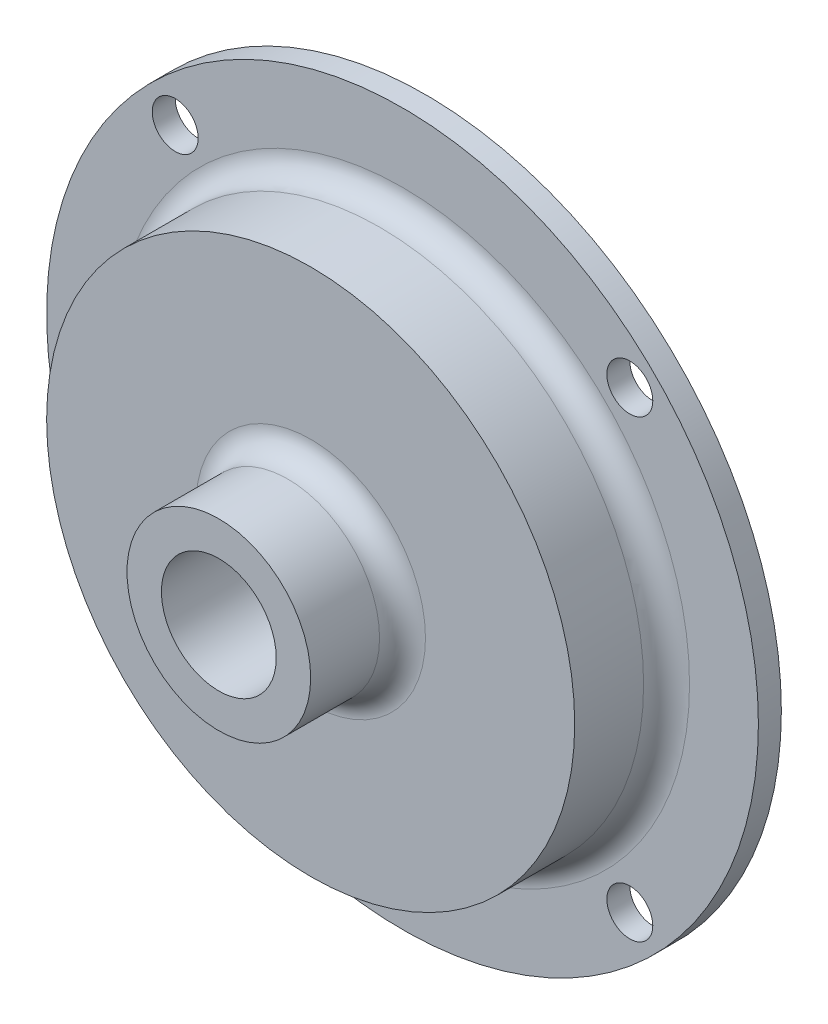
from build123d import *

# Parameters (mm, degrees)
SKETCH1_R           = 49.2125
SKETCH1_R_2         = 3.175
BASE_EXTRUDE_DEPTH  = 3.175
SKETCH2_R           = 36.5125
BOSS_EXTRUDE1_DEPTH = 12.7
SKETCH3_R           = 12.7
BOSS_EXTRUDE2_DEPTH = 12.7
FILLET1_R           = 3.175
SKETCH4_R           = 7.9375
CUT_EXTRUDE1_DEPTH  = 76.23477213


with BuildPart() as part:
    # Sketch1 → Base-Extrude (new body)
    with BuildSketch(Plane.XY):
        Circle(SKETCH1_R)
        with Locations((31.430896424, 31.430896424)):
            Circle(SKETCH1_R_2, mode=Mode.SUBTRACT)
        with Locations((-31.430896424, -31.430896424)):
            Circle(SKETCH1_R_2, mode=Mode.SUBTRACT)
        with Locations((31.430896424, -31.430896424)):
            Circle(SKETCH1_R_2, mode=Mode.SUBTRACT)
        with Locations((-31.430896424, 31.430896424)):
            Circle(SKETCH1_R_2, mode=Mode.SUBTRACT)
    extrude(amount=BASE_EXTRUDE_DEPTH)

    # Sketch2 → Boss-Extrude1 (add)
    with BuildSketch(Plane.XY.offset(3.175)):
        Circle(SKETCH2_R)
    extrude(amount=BOSS_EXTRUDE1_DEPTH)

    # Sketch3 → Boss-Extrude2 (add)
    with BuildSketch(Plane.XY.offset(15.875)):
        Circle(SKETCH3_R)
    extrude(amount=BOSS_EXTRUDE2_DEPTH)

    # Fillet1
    fillet1_edges = [part.edges().sort_by_distance(p)[0] for p in [
        (-36.5125, 0, 3.175),
        (-12.7, 0, 15.875),
    ]]
    fillet(fillet1_edges, radius=FILLET1_R)

    # Sketch4 → Cut-Extrude1 (cut, through all)
    with BuildSketch(Plane.XY.offset(28.575)):
        Circle(SKETCH4_R)
    extrude(amount=-CUT_EXTRUDE1_DEPTH, mode=Mode.SUBTRACT)


solid = part.part
